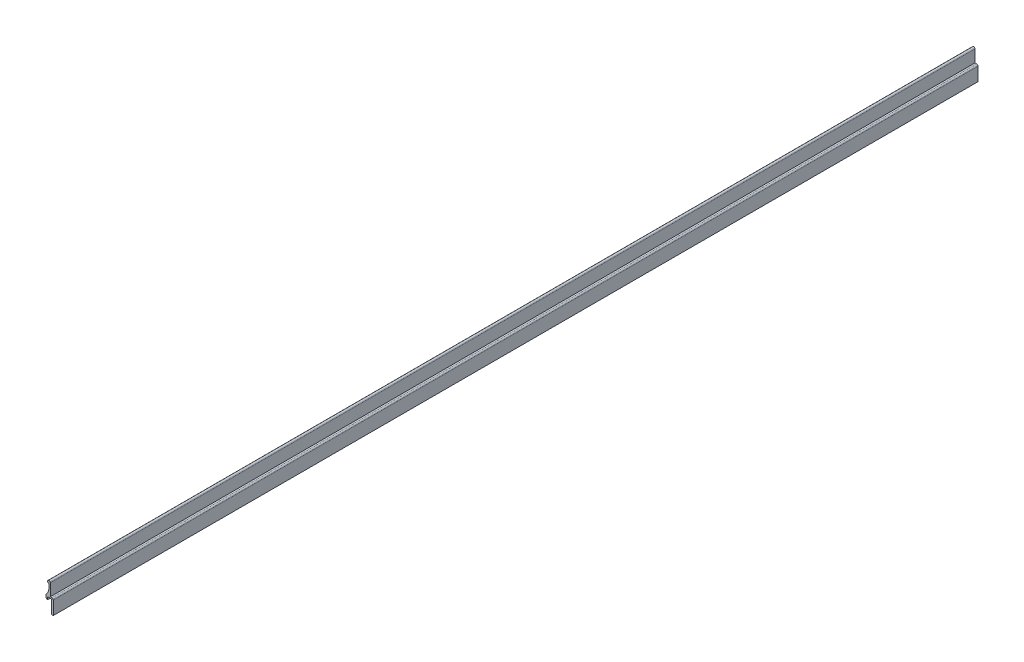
ISO-10303-21;
HEADER;
FILE_DESCRIPTION(('STEP AP214'),'2;1');
FILE_NAME('part.step','',(''),(''),'','','');
FILE_SCHEMA(('AUTOMOTIVE_DESIGN { 1 0 10303 214 1 1 1 1 }'));
ENDSEC;
DATA;
#1=APPLICATION_CONTEXT('core data for automotive mechanical design processes');
#2=APPLICATION_PROTOCOL_DEFINITION('international standard','automotive_design',2000,#1);
#3=PRODUCT_CONTEXT('',#1,'mechanical');
#4=PRODUCT('Part','Part','',(#3));
#5=PRODUCT_RELATED_PRODUCT_CATEGORY('part','',(#4));
#6=PRODUCT_DEFINITION_FORMATION('','',#4);
#7=PRODUCT_DEFINITION_CONTEXT('part definition',#1,'design');
#8=PRODUCT_DEFINITION('design','',#6,#7);
#9=PRODUCT_DEFINITION_SHAPE('','',#8);
#10=(LENGTH_UNIT() NAMED_UNIT(*) SI_UNIT(.MILLI.,.METRE.));
#11=(NAMED_UNIT(*) PLANE_ANGLE_UNIT() SI_UNIT($,.RADIAN.));
#12=(NAMED_UNIT(*) SI_UNIT($,.STERADIAN.) SOLID_ANGLE_UNIT());
#13=UNCERTAINTY_MEASURE_WITH_UNIT(LENGTH_MEASURE(1.E-05),#10,'distance_accuracy_value','');
#14=(GEOMETRIC_REPRESENTATION_CONTEXT(3) GLOBAL_UNCERTAINTY_ASSIGNED_CONTEXT((#13)) GLOBAL_UNIT_ASSIGNED_CONTEXT((#10,
#11,#12)) REPRESENTATION_CONTEXT('',''));
#15=CARTESIAN_POINT('',(0.,0.,0.));
#16=DIRECTION('',(0.,0.,1.));
#17=DIRECTION('',(1.,0.,0.));
#18=AXIS2_PLACEMENT_3D('',#15,#16,#17);
#19=CARTESIAN_POINT('',(0.999999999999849,10.,0.));
#20=DIRECTION('',(0.,0.,-1.));
#21=DIRECTION('',(0.,1.,0.));
#22=AXIS2_PLACEMENT_3D('',#19,#20,#21);
#23=CYLINDRICAL_SURFACE('',#22,0.999999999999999);
#24=CARTESIAN_POINT('',(0.999999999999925,9.99999999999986,-686.999999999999));
#25=DIRECTION('',(0.,0.,-1.));
#26=DIRECTION('',(0.,1.,0.));
#27=AXIS2_PLACEMENT_3D('',#24,#25,#26);
#28=CIRCLE('',#27,0.999999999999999);
#29=CARTESIAN_POINT('',(0.999999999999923,8.99999999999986,-686.999999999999));
#30=VERTEX_POINT('',#29);
#31=CARTESIAN_POINT('',(1.99999999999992,9.99999999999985,-686.999999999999));
#32=VERTEX_POINT('',#31);
#33=EDGE_CURVE('E168',#30,#32,#28,.T.);
#34=ORIENTED_EDGE('',*,*,#33,.F.);
#35=DIRECTION('',(0.,0.,-1.));
#36=VECTOR('',#35,1.);
#37=CARTESIAN_POINT('',(0.999999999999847,9.00000000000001,0.));
#38=LINE('',#37,#36);
#39=CARTESIAN_POINT('',(0.999999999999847,9.00000000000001,0.));
#40=VERTEX_POINT('',#39);
#41=EDGE_CURVE('E11',#40,#30,#38,.T.);
#42=ORIENTED_EDGE('',*,*,#41,.F.);
#43=CARTESIAN_POINT('',(0.999999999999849,10.,0.));
#44=DIRECTION('',(0.,0.,-1.));
#45=DIRECTION('',(0.,1.,0.));
#46=AXIS2_PLACEMENT_3D('',#43,#44,#45);
#47=CIRCLE('',#46,0.999999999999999);
#48=CARTESIAN_POINT('',(1.99999999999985,10.,0.));
#49=VERTEX_POINT('',#48);
#50=EDGE_CURVE('E206',#40,#49,#47,.T.);
#51=ORIENTED_EDGE('',*,*,#50,.T.);
#52=DIRECTION('',(0.,0.,-1.));
#53=VECTOR('',#52,1.);
#54=CARTESIAN_POINT('',(1.99999999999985,10.,0.));
#55=LINE('',#54,#53);
#56=EDGE_CURVE('E38',#49,#32,#55,.T.);
#57=ORIENTED_EDGE('',*,*,#56,.T.);
#58=EDGE_LOOP('',(#34,#42,#51,#57));
#59=FACE_BOUND('',#58,.T.);
#60=ADVANCED_FACE('F35',(#59),#23,.T.);
#61=CARTESIAN_POINT('',(0.999999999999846,6.50999092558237,0.));
#62=DIRECTION('',(-1.,0.,0.));
#63=DIRECTION('',(0.,-1.,0.));
#64=AXIS2_PLACEMENT_3D('',#61,#62,#63);
#65=PLANE('',#64);
#66=DIRECTION('',(0.,1.,0.));
#67=VECTOR('',#66,1.);
#68=CARTESIAN_POINT('',(0.999999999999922,6.50999092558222,-686.999999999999));
#69=LINE('',#68,#67);
#70=CARTESIAN_POINT('',(0.999999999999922,6.50999092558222,-686.999999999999));
#71=VERTEX_POINT('',#70);
#72=EDGE_CURVE('E204',#71,#30,#69,.T.);
#73=ORIENTED_EDGE('',*,*,#72,.F.);
#74=DIRECTION('',(0.,0.,-1.));
#75=VECTOR('',#74,1.);
#76=CARTESIAN_POINT('',(0.999999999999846,6.50999092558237,0.));
#77=LINE('',#76,#75);
#78=CARTESIAN_POINT('',(0.999999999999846,6.50999092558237,0.));
#79=VERTEX_POINT('',#78);
#80=EDGE_CURVE('E44',#79,#71,#77,.T.);
#81=ORIENTED_EDGE('',*,*,#80,.F.);
#82=DIRECTION('',(0.,1.,0.));
#83=VECTOR('',#82,1.);
#84=CARTESIAN_POINT('',(0.999999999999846,6.50999092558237,0.));
#85=LINE('',#84,#83);
#86=EDGE_CURVE('E158',#79,#40,#85,.T.);
#87=ORIENTED_EDGE('',*,*,#86,.T.);
#88=ORIENTED_EDGE('',*,*,#41,.T.);
#89=EDGE_LOOP('',(#73,#81,#87,#88));
#90=FACE_BOUND('',#89,.T.);
#91=ADVANCED_FACE('F230',(#90),#65,.T.);
#92=CARTESIAN_POINT('',(-7.00000000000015,6.50999092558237,0.));
#93=DIRECTION('',(0.,0.,-1.));
#94=DIRECTION('',(0.,1.,0.));
#95=AXIS2_PLACEMENT_3D('',#92,#93,#94);
#96=CYLINDRICAL_SURFACE('',#95,8.);
#97=CARTESIAN_POINT('',(-7.00000000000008,6.50999092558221,-686.999999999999));
#98=DIRECTION('',(0.,0.,1.));
#99=DIRECTION('',(0.,-1.,0.));
#100=AXIS2_PLACEMENT_3D('',#97,#98,#99);
#101=CIRCLE('',#100,8.);
#102=CARTESIAN_POINT('',(-1.20000000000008,0.999999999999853,-686.999999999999));
#103=VERTEX_POINT('',#102);
#104=EDGE_CURVE('E145',#103,#71,#101,.T.);
#105=ORIENTED_EDGE('',*,*,#104,.F.);
#106=DIRECTION('',(0.,0.,-1.));
#107=VECTOR('',#106,1.);
#108=CARTESIAN_POINT('',(-1.20000000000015,1.00000000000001,0.));
#109=LINE('',#108,#107);
#110=CARTESIAN_POINT('',(-1.20000000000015,1.00000000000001,0.));
#111=VERTEX_POINT('',#110);
#112=EDGE_CURVE('E140',#111,#103,#109,.T.);
#113=ORIENTED_EDGE('',*,*,#112,.F.);
#114=CARTESIAN_POINT('',(-7.00000000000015,6.50999092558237,0.));
#115=DIRECTION('',(0.,0.,1.));
#116=DIRECTION('',(0.,-1.,0.));
#117=AXIS2_PLACEMENT_3D('',#114,#115,#116);
#118=CIRCLE('',#117,8.);
#119=EDGE_CURVE('E143',#111,#79,#118,.T.);
#120=ORIENTED_EDGE('',*,*,#119,.T.);
#121=ORIENTED_EDGE('',*,*,#80,.T.);
#122=EDGE_LOOP('',(#105,#113,#120,#121));
#123=FACE_BOUND('',#122,.T.);
#124=ADVANCED_FACE('F142',(#123),#96,.F.);
#125=CARTESIAN_POINT('',(-0.968918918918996,-1.84999999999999,0.));
#126=DIRECTION('',(-0.996729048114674,-0.080815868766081,0.));
#127=DIRECTION('',(0.080815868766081,-0.996729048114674,0.));
#128=AXIS2_PLACEMENT_3D('',#125,#126,#127);
#129=PLANE('',#128);
#130=DIRECTION('',(-0.080815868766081,0.996729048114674,0.));
#131=VECTOR('',#130,1.);
#132=CARTESIAN_POINT('',(-0.968918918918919,-1.85000000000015,-686.999999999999));
#133=LINE('',#132,#131);
#134=CARTESIAN_POINT('',(-0.968918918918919,-1.85000000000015,-686.999999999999));
#135=VERTEX_POINT('',#134);
#136=EDGE_CURVE('E201',#135,#103,#133,.T.);
#137=ORIENTED_EDGE('',*,*,#136,.F.);
#138=DIRECTION('',(0.,0.,-1.));
#139=VECTOR('',#138,1.);
#140=CARTESIAN_POINT('',(-0.968918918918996,-1.84999999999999,0.));
#141=LINE('',#140,#139);
#142=CARTESIAN_POINT('',(-0.968918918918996,-1.84999999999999,0.));
#143=VERTEX_POINT('',#142);
#144=EDGE_CURVE('E150',#143,#135,#141,.T.);
#145=ORIENTED_EDGE('',*,*,#144,.F.);
#146=DIRECTION('',(-0.080815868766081,0.996729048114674,0.));
#147=VECTOR('',#146,1.);
#148=CARTESIAN_POINT('',(-0.968918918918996,-1.84999999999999,0.));
#149=LINE('',#148,#147);
#150=EDGE_CURVE('E156',#143,#111,#149,.T.);
#151=ORIENTED_EDGE('',*,*,#150,.T.);
#152=ORIENTED_EDGE('',*,*,#112,.T.);
#153=EDGE_LOOP('',(#137,#145,#151,#152));
#154=FACE_BOUND('',#153,.T.);
#155=ADVANCED_FACE('F160',(#154),#129,.T.);
#156=CARTESIAN_POINT('',(0.149999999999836,-1.84999999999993,0.));
#157=DIRECTION('',(0.,-1.,0.));
#158=DIRECTION('',(1.,0.,0.));
#159=AXIS2_PLACEMENT_3D('',#156,#157,#158);
#160=PLANE('',#159);
#161=DIRECTION('',(-1.,0.,0.));
#162=VECTOR('',#161,1.);
#163=CARTESIAN_POINT('',(0.149999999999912,-1.85000000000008,-686.999999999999));
#164=LINE('',#163,#162);
#165=CARTESIAN_POINT('',(0.149999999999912,-1.85000000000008,-686.999999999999));
#166=VERTEX_POINT('',#165);
#167=EDGE_CURVE('E198',#166,#135,#164,.T.);
#168=ORIENTED_EDGE('',*,*,#167,.F.);
#169=DIRECTION('',(0.,0.,-1.));
#170=VECTOR('',#169,1.);
#171=CARTESIAN_POINT('',(0.149999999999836,-1.84999999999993,0.));
#172=LINE('',#171,#170);
#173=CARTESIAN_POINT('',(0.149999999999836,-1.84999999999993,0.));
#174=VERTEX_POINT('',#173);
#175=EDGE_CURVE('E210',#174,#166,#172,.T.);
#176=ORIENTED_EDGE('',*,*,#175,.F.);
#177=DIRECTION('',(-1.,0.,0.));
#178=VECTOR('',#177,1.);
#179=CARTESIAN_POINT('',(0.149999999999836,-1.84999999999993,0.));
#180=LINE('',#179,#178);
#181=EDGE_CURVE('E161',#174,#143,#180,.T.);
#182=ORIENTED_EDGE('',*,*,#181,.T.);
#183=ORIENTED_EDGE('',*,*,#144,.T.);
#184=EDGE_LOOP('',(#168,#176,#182,#183));
#185=FACE_BOUND('',#184,.T.);
#186=ADVANCED_FACE('F243',(#185),#160,.T.);
#187=CARTESIAN_POINT('',(-1.5621025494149E-13,0.,0.));
#188=DIRECTION('',(0.996729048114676,0.0808158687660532,0.));
#189=DIRECTION('',(-0.0808158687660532,0.996729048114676,0.));
#190=AXIS2_PLACEMENT_3D('',#187,#188,#189);
#191=PLANE('',#190);
#192=DIRECTION('',(0.0808158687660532,-0.996729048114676,0.));
#193=VECTOR('',#192,1.);
#194=CARTESIAN_POINT('',(0.,-1.37910516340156E-13,-686.999999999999));
#195=LINE('',#194,#193);
#196=CARTESIAN_POINT('',(0.,-1.37910516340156E-13,-686.999999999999));
#197=VERTEX_POINT('',#196);
#198=EDGE_CURVE('E195',#197,#166,#195,.T.);
#199=ORIENTED_EDGE('',*,*,#198,.F.);
#200=DIRECTION('',(0.,0.,-1.));
#201=VECTOR('',#200,1.);
#202=CARTESIAN_POINT('',(-1.5621025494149E-13,0.,0.));
#203=LINE('',#202,#201);
#204=CARTESIAN_POINT('',(-1.5621025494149E-13,0.,0.));
#205=VERTEX_POINT('',#204);
#206=EDGE_CURVE('E212',#205,#197,#203,.T.);
#207=ORIENTED_EDGE('',*,*,#206,.F.);
#208=DIRECTION('',(0.0808158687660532,-0.996729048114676,0.));
#209=VECTOR('',#208,1.);
#210=CARTESIAN_POINT('',(-1.5621025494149E-13,0.,0.));
#211=LINE('',#210,#209);
#212=EDGE_CURVE('E163',#205,#174,#211,.T.);
#213=ORIENTED_EDGE('',*,*,#212,.T.);
#214=ORIENTED_EDGE('',*,*,#175,.T.);
#215=EDGE_LOOP('',(#199,#207,#213,#214));
#216=FACE_BOUND('',#215,.T.);
#217=ADVANCED_FACE('F246',(#216),#191,.T.);
#218=CARTESIAN_POINT('',(2.49999999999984,0.,0.));
#219=DIRECTION('',(0.,-1.,0.));
#220=DIRECTION('',(0.,0.,-1.));
#221=AXIS2_PLACEMENT_3D('',#218,#219,#220);
#222=PLANE('',#221);
#223=DIRECTION('',(-1.,0.,0.));
#224=VECTOR('',#223,1.);
#225=CARTESIAN_POINT('',(2.49999999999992,-1.38073146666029E-13,-686.999999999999));
#226=LINE('',#225,#224);
#227=CARTESIAN_POINT('',(2.49999999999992,-1.38073146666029E-13,-686.999999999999));
#228=VERTEX_POINT('',#227);
#229=EDGE_CURVE('E192',#228,#197,#226,.T.);
#230=ORIENTED_EDGE('',*,*,#229,.F.);
#231=DIRECTION('',(0.,0.,-1.));
#232=VECTOR('',#231,1.);
#233=CARTESIAN_POINT('',(2.49999999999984,0.,0.));
#234=LINE('',#233,#232);
#235=CARTESIAN_POINT('',(2.49999999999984,0.,0.));
#236=VERTEX_POINT('',#235);
#237=EDGE_CURVE('E214',#236,#228,#234,.T.);
#238=ORIENTED_EDGE('',*,*,#237,.F.);
#239=DIRECTION('',(-1.,0.,0.));
#240=VECTOR('',#239,1.);
#241=CARTESIAN_POINT('',(2.49999999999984,0.,0.));
#242=LINE('',#241,#240);
#243=EDGE_CURVE('E403',#236,#205,#242,.T.);
#244=ORIENTED_EDGE('',*,*,#243,.T.);
#245=ORIENTED_EDGE('',*,*,#206,.T.);
#246=EDGE_LOOP('',(#230,#238,#244,#245));
#247=FACE_BOUND('',#246,.T.);
#248=ADVANCED_FACE('F250',(#247),#222,.T.);
#249=CARTESIAN_POINT('',(2.49999999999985,-0.499999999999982,0.));
#250=DIRECTION('',(0.,0.,-1.));
#251=DIRECTION('',(0.,1.,0.));
#252=AXIS2_PLACEMENT_3D('',#249,#250,#251);
#253=CYLINDRICAL_SURFACE('',#252,0.499999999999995);
#254=CARTESIAN_POINT('',(2.49999999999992,-0.500000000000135,-686.999999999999));
#255=DIRECTION('',(0.,0.,1.));
#256=DIRECTION('',(0.,-1.,0.));
#257=AXIS2_PLACEMENT_3D('',#254,#255,#256);
#258=CIRCLE('',#257,0.499999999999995);
#259=CARTESIAN_POINT('',(2.99999999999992,-0.50000000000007,-686.999999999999));
#260=VERTEX_POINT('',#259);
#261=EDGE_CURVE('E189',#260,#228,#258,.T.);
#262=ORIENTED_EDGE('',*,*,#261,.F.);
#263=DIRECTION('',(0.,0.,-1.));
#264=VECTOR('',#263,1.);
#265=CARTESIAN_POINT('',(2.99999999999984,-0.499999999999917,0.));
#266=LINE('',#265,#264);
#267=CARTESIAN_POINT('',(2.99999999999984,-0.499999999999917,0.));
#268=VERTEX_POINT('',#267);
#269=EDGE_CURVE('E216',#268,#260,#266,.T.);
#270=ORIENTED_EDGE('',*,*,#269,.F.);
#271=CARTESIAN_POINT('',(2.49999999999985,-0.499999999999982,0.));
#272=DIRECTION('',(0.,0.,1.));
#273=DIRECTION('',(0.,-1.,0.));
#274=AXIS2_PLACEMENT_3D('',#271,#272,#273);
#275=CIRCLE('',#274,0.499999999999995);
#276=EDGE_CURVE('E396',#268,#236,#275,.T.);
#277=ORIENTED_EDGE('',*,*,#276,.T.);
#278=ORIENTED_EDGE('',*,*,#237,.T.);
#279=EDGE_LOOP('',(#262,#270,#277,#278));
#280=FACE_BOUND('',#279,.T.);
#281=ADVANCED_FACE('F254',(#280),#253,.F.);
#282=CARTESIAN_POINT('',(2.99999999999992,-9.99999999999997,0.));
#283=DIRECTION('',(-1.,0.,0.));
#284=DIRECTION('',(0.,-1.,0.));
#285=AXIS2_PLACEMENT_3D('',#282,#283,#284);
#286=PLANE('',#285);
#287=DIRECTION('',(0.,1.,0.));
#288=VECTOR('',#287,1.);
#289=CARTESIAN_POINT('',(3.,-10.0000000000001,-686.999999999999));
#290=LINE('',#289,#288);
#291=CARTESIAN_POINT('',(3.,-10.0000000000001,-686.999999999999));
#292=VERTEX_POINT('',#291);
#293=EDGE_CURVE('E186',#292,#260,#290,.T.);
#294=ORIENTED_EDGE('',*,*,#293,.F.);
#295=DIRECTION('',(0.,0.,-1.));
#296=VECTOR('',#295,1.);
#297=CARTESIAN_POINT('',(2.99999999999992,-9.99999999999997,0.));
#298=LINE('',#297,#296);
#299=CARTESIAN_POINT('',(2.99999999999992,-9.99999999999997,0.));
#300=VERTEX_POINT('',#299);
#301=EDGE_CURVE('E218',#300,#292,#298,.T.);
#302=ORIENTED_EDGE('',*,*,#301,.F.);
#303=DIRECTION('',(0.,1.,0.));
#304=VECTOR('',#303,1.);
#305=CARTESIAN_POINT('',(2.99999999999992,-9.99999999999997,0.));
#306=LINE('',#305,#304);
#307=EDGE_CURVE('E392',#300,#268,#306,.T.);
#308=ORIENTED_EDGE('',*,*,#307,.T.);
#309=ORIENTED_EDGE('',*,*,#269,.T.);
#310=EDGE_LOOP('',(#294,#302,#308,#309));
#311=FACE_BOUND('',#310,.T.);
#312=ADVANCED_FACE('F258',(#311),#286,.T.);
#313=CARTESIAN_POINT('',(4.19999999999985,-9.9999999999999,0.));
#314=DIRECTION('',(0.,-1.,0.));
#315=DIRECTION('',(1.,0.,0.));
#316=AXIS2_PLACEMENT_3D('',#313,#314,#315);
#317=PLANE('',#316);
#318=DIRECTION('',(-1.,0.,0.));
#319=VECTOR('',#318,1.);
#320=CARTESIAN_POINT('',(4.19999999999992,-10.,-686.999999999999));
#321=LINE('',#320,#319);
#322=CARTESIAN_POINT('',(4.19999999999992,-10.,-686.999999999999));
#323=VERTEX_POINT('',#322);
#324=EDGE_CURVE('E183',#323,#292,#321,.T.);
#325=ORIENTED_EDGE('',*,*,#324,.F.);
#326=DIRECTION('',(0.,0.,-1.));
#327=VECTOR('',#326,1.);
#328=CARTESIAN_POINT('',(4.19999999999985,-9.9999999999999,0.));
#329=LINE('',#328,#327);
#330=CARTESIAN_POINT('',(4.19999999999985,-9.9999999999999,0.));
#331=VERTEX_POINT('',#330);
#332=EDGE_CURVE('E220',#331,#323,#329,.T.);
#333=ORIENTED_EDGE('',*,*,#332,.F.);
#334=DIRECTION('',(-1.,0.,0.));
#335=VECTOR('',#334,1.);
#336=CARTESIAN_POINT('',(4.19999999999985,-9.9999999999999,0.));
#337=LINE('',#336,#335);
#338=EDGE_CURVE('E408',#331,#300,#337,.T.);
#339=ORIENTED_EDGE('',*,*,#338,.T.);
#340=ORIENTED_EDGE('',*,*,#301,.T.);
#341=EDGE_LOOP('',(#325,#333,#339,#340));
#342=FACE_BOUND('',#341,.T.);
#343=ADVANCED_FACE('F262',(#342),#317,.T.);
#344=CARTESIAN_POINT('',(4.19999999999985,0.,0.));
#345=DIRECTION('',(1.,0.,0.));
#346=DIRECTION('',(0.,1.,0.));
#347=AXIS2_PLACEMENT_3D('',#344,#345,#346);
#348=PLANE('',#347);
#349=DIRECTION('',(0.,-1.,0.));
#350=VECTOR('',#349,1.);
#351=CARTESIAN_POINT('',(4.19999999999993,-1.3715417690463E-13,-686.999999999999));
#352=LINE('',#351,#350);
#353=CARTESIAN_POINT('',(4.19999999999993,-1.3715417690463E-13,-686.999999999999));
#354=VERTEX_POINT('',#353);
#355=EDGE_CURVE('E180',#354,#323,#352,.T.);
#356=ORIENTED_EDGE('',*,*,#355,.F.);
#357=DIRECTION('',(0.,0.,-1.));
#358=VECTOR('',#357,1.);
#359=CARTESIAN_POINT('',(4.19999999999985,0.,0.));
#360=LINE('',#359,#358);
#361=CARTESIAN_POINT('',(4.19999999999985,0.,0.));
#362=VERTEX_POINT('',#361);
#363=EDGE_CURVE('E222',#362,#354,#360,.T.);
#364=ORIENTED_EDGE('',*,*,#363,.F.);
#365=DIRECTION('',(0.,-1.,0.));
#366=VECTOR('',#365,1.);
#367=CARTESIAN_POINT('',(4.19999999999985,0.,0.));
#368=LINE('',#367,#366);
#369=EDGE_CURVE('E385',#362,#331,#368,.T.);
#370=ORIENTED_EDGE('',*,*,#369,.T.);
#371=ORIENTED_EDGE('',*,*,#332,.T.);
#372=EDGE_LOOP('',(#356,#364,#370,#371));
#373=FACE_BOUND('',#372,.T.);
#374=ADVANCED_FACE('F266',(#373),#348,.T.);
#375=CARTESIAN_POINT('',(3.19999999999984,0.,0.));
#376=DIRECTION('',(0.,0.,-1.));
#377=DIRECTION('',(0.,1.,0.));
#378=AXIS2_PLACEMENT_3D('',#375,#376,#377);
#379=CYLINDRICAL_SURFACE('',#378,1.00000000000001);
#380=CARTESIAN_POINT('',(3.19999999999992,-1.37910516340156E-13,-686.999999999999));
#381=DIRECTION('',(0.,0.,-1.));
#382=DIRECTION('',(0.,1.,0.));
#383=AXIS2_PLACEMENT_3D('',#380,#381,#382);
#384=CIRCLE('',#383,1.00000000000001);
#385=CARTESIAN_POINT('',(3.19999999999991,0.999999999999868,-686.999999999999));
#386=VERTEX_POINT('',#385);
#387=EDGE_CURVE('E177',#386,#354,#384,.T.);
#388=ORIENTED_EDGE('',*,*,#387,.F.);
#389=DIRECTION('',(0.,0.,-1.));
#390=VECTOR('',#389,1.);
#391=CARTESIAN_POINT('',(3.19999999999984,1.00000000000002,0.));
#392=LINE('',#391,#390);
#393=CARTESIAN_POINT('',(3.19999999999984,1.00000000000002,0.));
#394=VERTEX_POINT('',#393);
#395=EDGE_CURVE('E224',#394,#386,#392,.T.);
#396=ORIENTED_EDGE('',*,*,#395,.F.);
#397=CARTESIAN_POINT('',(3.19999999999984,0.,0.));
#398=DIRECTION('',(0.,0.,-1.));
#399=DIRECTION('',(0.,1.,0.));
#400=AXIS2_PLACEMENT_3D('',#397,#398,#399);
#401=CIRCLE('',#400,1.00000000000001);
#402=EDGE_CURVE('E381',#394,#362,#401,.T.);
#403=ORIENTED_EDGE('',*,*,#402,.T.);
#404=ORIENTED_EDGE('',*,*,#363,.T.);
#405=EDGE_LOOP('',(#388,#396,#403,#404));
#406=FACE_BOUND('',#405,.T.);
#407=ADVANCED_FACE('F270',(#406),#379,.T.);
#408=CARTESIAN_POINT('',(1.99999999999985,1.00000000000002,0.));
#409=DIRECTION('',(0.,1.,0.));
#410=DIRECTION('',(-1.,0.,0.));
#411=AXIS2_PLACEMENT_3D('',#408,#409,#410);
#412=PLANE('',#411);
#413=DIRECTION('',(1.,0.,0.));
#414=VECTOR('',#413,1.);
#415=CARTESIAN_POINT('',(1.99999999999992,0.999999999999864,-686.999999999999));
#416=LINE('',#415,#414);
#417=CARTESIAN_POINT('',(1.99999999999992,0.999999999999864,-686.999999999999));
#418=VERTEX_POINT('',#417);
#419=EDGE_CURVE('E174',#418,#386,#416,.T.);
#420=ORIENTED_EDGE('',*,*,#419,.F.);
#421=DIRECTION('',(0.,0.,-1.));
#422=VECTOR('',#421,1.);
#423=CARTESIAN_POINT('',(1.99999999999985,1.00000000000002,0.));
#424=LINE('',#423,#422);
#425=CARTESIAN_POINT('',(1.99999999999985,1.00000000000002,0.));
#426=VERTEX_POINT('',#425);
#427=EDGE_CURVE('E225',#426,#418,#424,.T.);
#428=ORIENTED_EDGE('',*,*,#427,.F.);
#429=DIRECTION('',(1.,0.,0.));
#430=VECTOR('',#429,1.);
#431=CARTESIAN_POINT('',(1.99999999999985,1.00000000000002,0.));
#432=LINE('',#431,#430);
#433=EDGE_CURVE('E412',#426,#394,#432,.T.);
#434=ORIENTED_EDGE('',*,*,#433,.T.);
#435=ORIENTED_EDGE('',*,*,#395,.T.);
#436=EDGE_LOOP('',(#420,#428,#434,#435));
#437=FACE_BOUND('',#436,.T.);
#438=ADVANCED_FACE('F274',(#437),#412,.T.);
#439=CARTESIAN_POINT('',(1.99999999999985,10.,0.));
#440=DIRECTION('',(1.,0.,0.));
#441=DIRECTION('',(0.,0.,-1.));
#442=AXIS2_PLACEMENT_3D('',#439,#440,#441);
#443=PLANE('',#442);
#444=DIRECTION('',(0.,-1.,0.));
#445=VECTOR('',#444,1.);
#446=CARTESIAN_POINT('',(1.99999999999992,9.99999999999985,-686.999999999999));
#447=LINE('',#446,#445);
#448=EDGE_CURVE('E171',#32,#418,#447,.T.);
#449=ORIENTED_EDGE('',*,*,#448,.F.);
#450=ORIENTED_EDGE('',*,*,#56,.F.);
#451=DIRECTION('',(0.,-1.,0.));
#452=VECTOR('',#451,1.);
#453=CARTESIAN_POINT('',(1.99999999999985,10.,0.));
#454=LINE('',#453,#452);
#455=EDGE_CURVE('E414',#49,#426,#454,.T.);
#456=ORIENTED_EDGE('',*,*,#455,.T.);
#457=ORIENTED_EDGE('',*,*,#427,.T.);
#458=EDGE_LOOP('',(#449,#450,#456,#457));
#459=FACE_BOUND('',#458,.T.);
#460=ADVANCED_FACE('F227',(#459),#443,.T.);
#461=CARTESIAN_POINT('',(0.999999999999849,10.,0.));
#462=DIRECTION('',(0.,0.,-1.));
#463=DIRECTION('',(0.,1.,0.));
#464=AXIS2_PLACEMENT_3D('',#461,#462,#463);
#465=PLANE('',#464);
#466=ORIENTED_EDGE('',*,*,#50,.F.);
#467=ORIENTED_EDGE('',*,*,#86,.F.);
#468=ORIENTED_EDGE('',*,*,#119,.F.);
#469=ORIENTED_EDGE('',*,*,#150,.F.);
#470=ORIENTED_EDGE('',*,*,#181,.F.);
#471=ORIENTED_EDGE('',*,*,#212,.F.);
#472=ORIENTED_EDGE('',*,*,#243,.F.);
#473=ORIENTED_EDGE('',*,*,#276,.F.);
#474=ORIENTED_EDGE('',*,*,#307,.F.);
#475=ORIENTED_EDGE('',*,*,#338,.F.);
#476=ORIENTED_EDGE('',*,*,#369,.F.);
#477=ORIENTED_EDGE('',*,*,#402,.F.);
#478=ORIENTED_EDGE('',*,*,#433,.F.);
#479=ORIENTED_EDGE('',*,*,#455,.F.);
#480=EDGE_LOOP('',(#466,#467,#468,#469,#470,#471,#472,#473,#474,#475,#476,#477,#478,#479));
#481=FACE_BOUND('',#480,.T.);
#482=ADVANCED_FACE('F154',(#481),#465,.F.);
#483=CARTESIAN_POINT('',(0.999999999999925,9.99999999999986,-686.999999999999));
#484=DIRECTION('',(0.,0.,-1.));
#485=DIRECTION('',(0.,1.,0.));
#486=AXIS2_PLACEMENT_3D('',#483,#484,#485);
#487=PLANE('',#486);
#488=ORIENTED_EDGE('',*,*,#33,.T.);
#489=ORIENTED_EDGE('',*,*,#448,.T.);
#490=ORIENTED_EDGE('',*,*,#419,.T.);
#491=ORIENTED_EDGE('',*,*,#387,.T.);
#492=ORIENTED_EDGE('',*,*,#355,.T.);
#493=ORIENTED_EDGE('',*,*,#324,.T.);
#494=ORIENTED_EDGE('',*,*,#293,.T.);
#495=ORIENTED_EDGE('',*,*,#261,.T.);
#496=ORIENTED_EDGE('',*,*,#229,.T.);
#497=ORIENTED_EDGE('',*,*,#198,.T.);
#498=ORIENTED_EDGE('',*,*,#167,.T.);
#499=ORIENTED_EDGE('',*,*,#136,.T.);
#500=ORIENTED_EDGE('',*,*,#104,.T.);
#501=ORIENTED_EDGE('',*,*,#72,.T.);
#502=EDGE_LOOP('',(#488,#489,#490,#491,#492,#493,#494,#495,#496,#497,#498,#499,#500,#501));
#503=FACE_BOUND('',#502,.T.);
#504=ADVANCED_FACE('F229',(#503),#487,.T.);
#505=CLOSED_SHELL('',(#60,#91,#124,#155,#186,#217,#248,#281,#312,#343,#374,#407,#438,#460,#482,#504));
#506=MANIFOLD_SOLID_BREP('B2',#505);
#507=ADVANCED_BREP_SHAPE_REPRESENTATION('',(#18,#506),#14);
#508=SHAPE_DEFINITION_REPRESENTATION(#9,#507);
ENDSEC;
END-ISO-10303-21;
